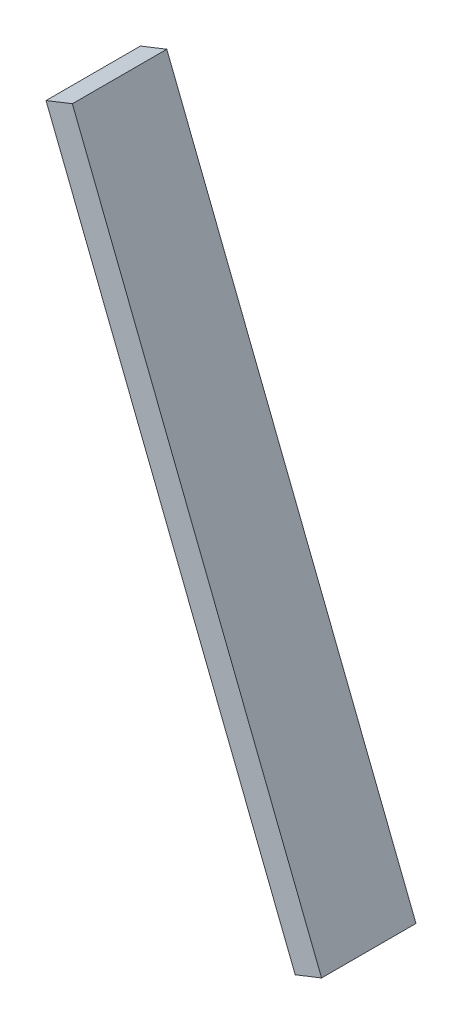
from build123d import *

# Parameters (mm, degrees)
BOSS_EXTRU_1_DEPTH = 5000


with BuildPart() as part:
    # Esquisse1 → Boss.-Extru.1 (new, symmetric)
    with BuildSketch(Plane.XY):
        Polygon((26392.001866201, -67000), (0, 0), (-2791.252703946, -1099.503680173), (23600.749162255, -68099.503680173), align=None)
    extrude(amount=BOSS_EXTRU_1_DEPTH, both=True)


solid = part.part
